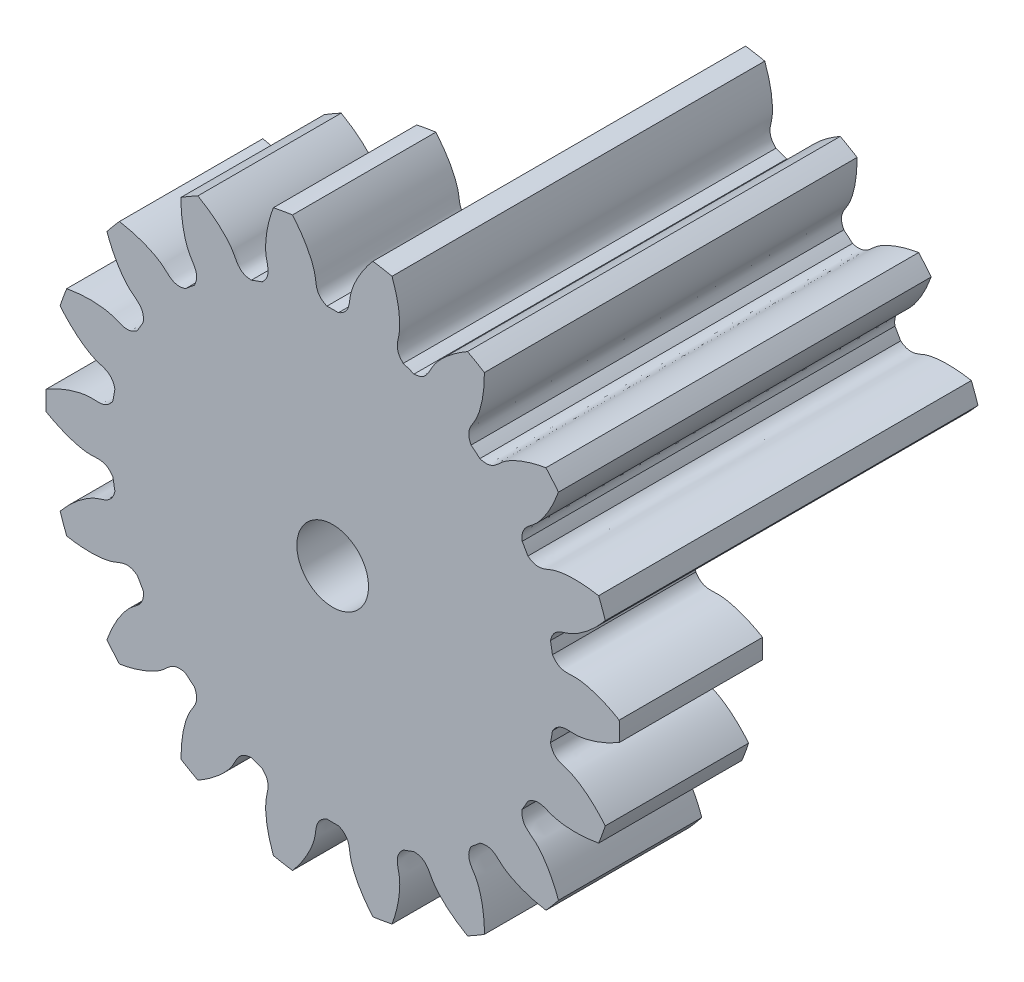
from build123d import *

# Parameters (mm, degrees)
SKETCH_1_R               = 20
EXTRUDE_1_DEPTH          = 26
CUT_EXTRUDE_1_DEPTH      = 39.418745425
PATTERN_CIRCULAR_1_COUNT = 18
SKETCH_4_R               = 2.5
CUT_EXTRUDE_2_DEPTH      = 39.316432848
CUT_EXTRUDE_3_DEPTH      = 16


with BuildPart() as part:
    # Sketch 1 → Extrude 1 (new body)
    with BuildSketch(Plane.XY):
        with Locations(Location((0, 0, 0), (0, 0, 180))):
            Circle(SKETCH_1_R)
    extrude(amount=EXTRUDE_1_DEPTH)

    # Sketch 2 → Cut-Extrude 1 (cut, through all)
    with BuildSketch(Plane.XY):
        with BuildLine():
            ThreePointArc((0.398807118, 15.494868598), (0, 15.5), (-0.398807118, 15.494868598))
            add(Edge.make_bspline(
                [(-0.398807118, 15.494868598), (-1.23020808, 15.837360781), (-1.1255781, 16.477399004), (-1.263665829, 17.085190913), (-1.27750304, 17.141013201), (-1.294215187, 17.203080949), (-1.314049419, 17.271300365), (-1.337260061, 17.345568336), (-1.364095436, 17.425774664), (-1.394801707, 17.511801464), (-1.429621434, 17.603523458), (-1.46879375, 17.700807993), (-1.512554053, 17.803515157), (-1.561133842, 17.911497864), (-1.614760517, 18.02460196), (-1.673657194, 18.142666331), (-1.738042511, 18.265523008), (-1.80813045, 18.392997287), (-1.884130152, 18.524907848), (-1.96624574, 18.661066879), (-2.054676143, 18.801280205), (-2.149614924, 18.945347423), (-2.25125011, 19.09306204), (-2.359764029, 19.244211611), (-2.475333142, 19.398577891), (-2.598127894, 19.555936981), (-2.728312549, 19.716059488), (-2.866045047, 19.878710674), (-3.011476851, 20.043650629), (-3.164752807, 20.210634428), (-3.326011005, 20.379412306), (-3.495382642, 20.549729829), (-3.672991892, 20.72132807), (-3.858955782, 20.893943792), (-4.053384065, 21.067309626), (-4.256379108, 21.241154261), (-4.468035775, 21.415202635), (-4.68844132, 21.58917612), (-4.917675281, 21.762792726), (-5.155809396, 21.935767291), (-5.402907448, 22.107811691), (-5.748150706, 22.338079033), (-6.015110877, 22.504667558), (-6.197121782, 22.613356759)],
                knots=[0, 0, 0, 0, 0.187591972, 0.192996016, 0.1991206, 0.205965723, 0.213531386, 0.221817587, 0.230824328, 0.240551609, 0.250999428, 0.262167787, 0.274056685, 0.286666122, 0.299996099, 0.314046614, 0.32881767, 0.344309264, 0.360521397, 0.37745407, 0.395107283, 0.413481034, 0.432575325, 0.452390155, 0.472925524, 0.494181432, 0.51615788, 0.538854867, 0.562272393, 0.586410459, 0.611269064, 0.636848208, 0.663147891, 0.690168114, 0.717908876, 0.746370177, 0.775552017, 0.805454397, 0.836077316, 0.867420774, 0.899484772, 0.932269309, 1, 1, 1, 1], degree=3))
            ThreePointArc((-6.197121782, 22.613356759), (0, 23.447136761), (6.197121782, 22.613356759))
            add(Edge.make_bspline(
                [(0.398807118, 15.494868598), (1.23020808, 15.837360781), (1.1255781, 16.477399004), (1.263665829, 17.085190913), (1.27750304, 17.141013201), (1.294215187, 17.203080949), (1.314049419, 17.271300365), (1.337260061, 17.345568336), (1.364095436, 17.425774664), (1.394801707, 17.511801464), (1.429621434, 17.603523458), (1.46879375, 17.700807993), (1.512554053, 17.803515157), (1.561133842, 17.911497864), (1.614760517, 18.02460196), (1.673657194, 18.142666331), (1.738042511, 18.265523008), (1.80813045, 18.392997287), (1.884130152, 18.524907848), (1.96624574, 18.661066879), (2.054676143, 18.801280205), (2.149614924, 18.945347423), (2.25125011, 19.09306204), (2.359764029, 19.244211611), (2.475333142, 19.398577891), (2.598127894, 19.555936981), (2.728312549, 19.716059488), (2.866045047, 19.878710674), (3.011476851, 20.043650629), (3.164752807, 20.210634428), (3.326011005, 20.379412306), (3.495382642, 20.549729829), (3.672991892, 20.72132807), (3.858955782, 20.893943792), (4.053384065, 21.067309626), (4.256379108, 21.241154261), (4.468035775, 21.415202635), (4.68844132, 21.58917612), (4.917675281, 21.762792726), (5.155809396, 21.935767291), (5.402907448, 22.107811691), (5.748150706, 22.338079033), (6.015110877, 22.504667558), (6.197121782, 22.613356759)],
                knots=[0, 0, 0, 0, 0.187591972, 0.192996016, 0.1991206, 0.205965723, 0.213531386, 0.221817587, 0.230824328, 0.240551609, 0.250999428, 0.262167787, 0.274056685, 0.286666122, 0.299996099, 0.314046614, 0.32881767, 0.344309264, 0.360521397, 0.37745407, 0.395107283, 0.413481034, 0.432575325, 0.452390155, 0.472925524, 0.494181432, 0.51615788, 0.538854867, 0.562272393, 0.586410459, 0.611269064, 0.636848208, 0.663147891, 0.690168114, 0.717908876, 0.746370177, 0.775552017, 0.805454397, 0.836077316, 0.867420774, 0.899484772, 0.932269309, 1, 1, 1, 1], degree=3))
        make_face()
    cut_extrude_1 = extrude(amount=CUT_EXTRUDE_1_DEPTH, mode=Mode.SUBTRACT)

    # Pattern Circular 1: Cut-Extrude 1 ×18 about axis
    pattern_circular_1_axis = Axis((0, 0, 26), (0, 0, -1))
    for i in range(1, PATTERN_CIRCULAR_1_COUNT):
        add(cut_extrude_1.rotate(pattern_circular_1_axis, i * 360 / PATTERN_CIRCULAR_1_COUNT), mode=Mode.SUBTRACT)

    # Sketch 4 → Cut-Extrude 2 (cut, through all)
    with BuildSketch(Plane(origin=(0, 0, 0), x_dir=(-1, 0, 0), z_dir=(0, 0, -1))):
        Circle(SKETCH_4_R)
    extrude(amount=-CUT_EXTRUDE_2_DEPTH, mode=Mode.SUBTRACT)

    # Sketch 5 → Cut-Extrude 3 (cut)
    with BuildSketch(Plane(origin=(0, 0, 0), x_dir=(-1, 0, 0), z_dir=(0, 0, -1))):
        with BuildLine():
            Line((0, 15.5), (0, 4))
            ThreePointArc((0, 4), (2.828427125, 2.828427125), (4, 0))
            ThreePointArc((4, 0), (-0.348622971, -3.984778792), (-3.939231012, 0.694592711))
            Line((-3.939231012, 0.694592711), (-19.69615506, 3.472963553))
            ThreePointArc((-19.69615506, 3.472963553), (-1.743114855, -19.923893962), (20, 0))
            ThreePointArc((20, 0), (14.142135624, 14.142135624), (0, 20))
            Line((0, 20), (0, 15.5))
        make_face()
    extrude(amount=-CUT_EXTRUDE_3_DEPTH, mode=Mode.SUBTRACT)


solid = part.part
